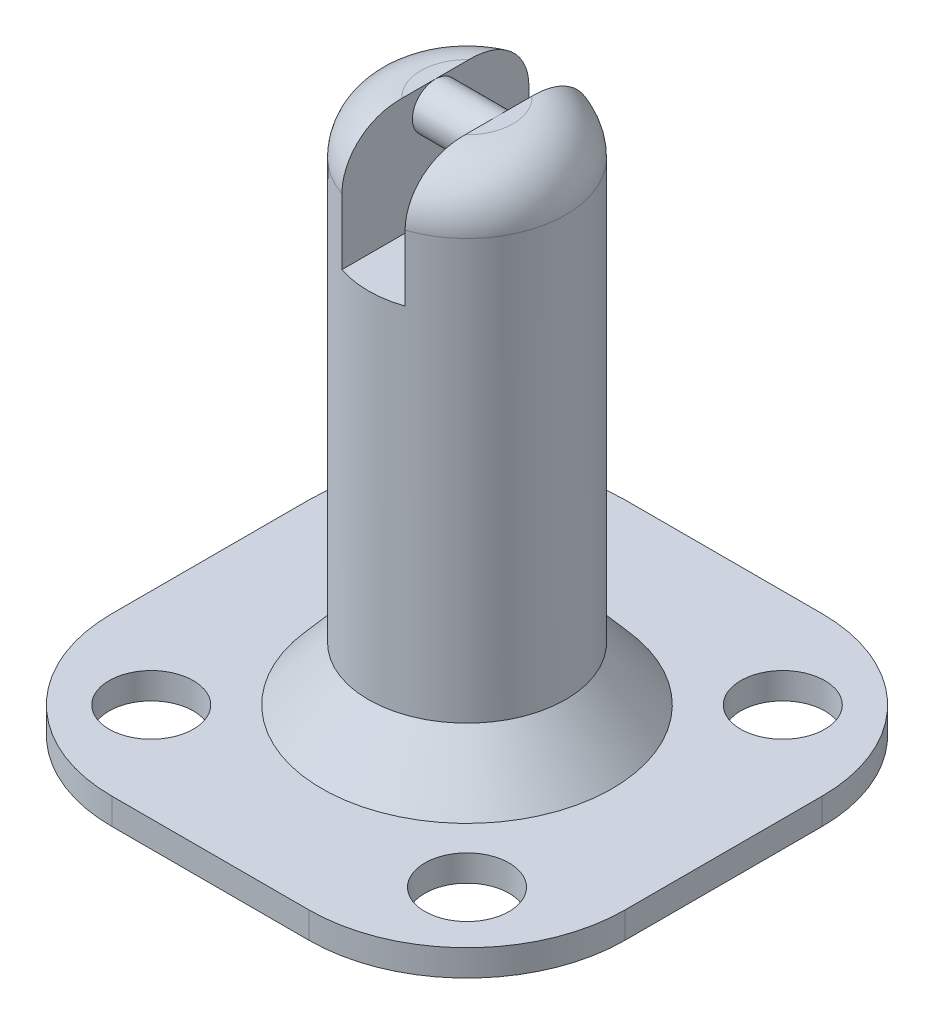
from build123d import *

# Parameters (mm, degrees)
ESQUISSE1_R                  = 3.75
BOSS_EXTRU_1_DEPTH           = 20
ENL_V_MAT_EXTRU_2_DEPTH      = 1.2
ENL_V_MAT_EXTRU_2_DEPTH_BACK = 1.2
ESQUISSE3_W                  = 7.5
ESQUISSE3_H                  = 3.5
ESQUISSE4_R                  = 0.875
BOSS_EXTRU_3_DEPTH           = 2.4
ENL_V_MAT_EXTRU_3_DEPTH      = 21.691181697
ENL_V_MAT_EXTRU_3_DEPTH_BACK = 21.691181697
ESQUISSE5_W                  = 2.4
ESQUISSE5_H                  = 1
CONG_1_R                     = 2
ESQUISSE7_W                  = 19.5
ESQUISSE7_H                  = 19.5
BOSS_EXTRU_4_DEPTH           = 1
CONG_2_R                     = 6
ENL_V_MAT_EXTRU_4_DEPTH      = 2


with BuildPart() as part:
    # Esquisse1 → Boss.-Extru.1 (new body)
    with BuildSketch(Plane(origin=(0, 0, 0), x_dir=(1, 0, 0), z_dir=(0, 1, 0))):
        with Locations(Location((0, 0, 0), (0, 0, 270))):
            Circle(ESQUISSE1_R)
    extrude(amount=BOSS_EXTRU_1_DEPTH)

    # Esquisse3 → Enl_v. mat.-Extru.2 (cut, two sides: drawn at the far end of the back side and taken through both)
    with BuildSketch(Plane(origin=(0, 0, 0), x_dir=(0, 0, -1), z_dir=(1, 0, 0)).offset(-ENL_V_MAT_EXTRU_2_DEPTH_BACK)):
        with Locations((0, 18.25)):
            Rectangle(ESQUISSE3_W, ESQUISSE3_H)
    extrude(amount=ENL_V_MAT_EXTRU_2_DEPTH + ENL_V_MAT_EXTRU_2_DEPTH_BACK, mode=Mode.SUBTRACT)

    # Esquisse4 → Boss.-Extru.3 (add)
    with BuildSketch(Plane(origin=(-1.2, 0, 0), x_dir=(0, 0, -1), z_dir=(1, 0, 0))):
        with Locations((0, 19.12)):
            Circle(ESQUISSE4_R)
    extrude(amount=BOSS_EXTRU_3_DEPTH)

    # Esquisse5 → Enl_v. mat.-Extru.3 (cut, two sides: drawn at the far end of the back side and taken through both)
    with BuildSketch(Plane.XY.offset(-ENL_V_MAT_EXTRU_3_DEPTH_BACK)):
        with Locations((0, 16)):
            Rectangle(ESQUISSE5_W, ESQUISSE5_H)
    extrude(amount=ENL_V_MAT_EXTRU_3_DEPTH + ENL_V_MAT_EXTRU_3_DEPTH_BACK, mode=Mode.SUBTRACT)

    # Cong_1
    cong_1_edges = [part.edges().sort_by_distance(p)[0] for p in [
        (3.75, 20, 0),
        (-3.75, 20, 0),
    ]]
    fillet(cong_1_edges, radius=CONG_1_R)

    # Esquisse6 → R_volution1 (revolve)
    with BuildSketch(Plane.XY, mode=Mode.PRIVATE) as r_volution1_sk:
        Polygon((-3.75, 0), (-5.516949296, 0), (-3.75, 2.048416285), align=None)
    revolve(r_volution1_sk.sketch.rotate(Axis((0, 18, 0), (0, -1, 0)), 71.337075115), axis=Axis((0, 18, 0), (0, -1, 0)))

    # Esquisse7 → Boss.-Extru.4 (add)
    with BuildSketch(Plane.XZ):
        Rectangle(ESQUISSE7_W, ESQUISSE7_H)
    extrude(amount=BOSS_EXTRU_4_DEPTH)

    # Cong_2
    cong_2_edges = [part.edges().sort_by_distance(p)[0] for p in [
        (-9.75, -0.5, 9.75),
        (-9.75, -0.5, -9.75),
        (9.75, -0.5, -9.75),
        (9.75, -0.5, 9.75),
    ]]
    fillet(cong_2_edges, radius=CONG_2_R)

    # Esquisse8 → Enl_v. mat.-Extru.4 (cut)
    with BuildSketch(Plane(origin=(0, 0, 0), x_dir=(1, 0, 0), z_dir=(0, 1, 0))):
        with BuildLine():
            Line((-6, 4.4), (-6, 6))
            Line((-6, 6), (-4.4, 6))
            ThreePointArc((-4.4, 6), (-7.13137085, 7.13137085), (-6, 4.4))
        make_face()
        with BuildLine():
            Line((-4.4, 6), (-6, 6))
            Line((-6, 6), (-6, 4.4))
            ThreePointArc((-6, 4.4), (-4.86862915, 4.86862915), (-4.4, 6))
        make_face()
        with BuildLine():
            Line((-6, 4.4), (-6, 6))
            Line((-6, 6), (-4.4, 6))
            ThreePointArc((-4.4, 6), (-7.13137085, 7.13137085), (-6, 4.4))
        make_face()
        with BuildLine():
            Line((-4.4, 6), (-6, 6))
            Line((-6, 6), (-6, 4.4))
            ThreePointArc((-6, 4.4), (-4.86862915, 4.86862915), (-4.4, 6))
        make_face()
        with BuildLine():
            ThreePointArc((7.6, 6), (6, 7.6), (4.4, 6))
            Line((4.4, 6), (6, 6))
            Line((6, 6), (6, 4.4))
            ThreePointArc((6, 4.4), (7.13137085, 4.86862915), (7.6, 6))
        make_face()
        with BuildLine():
            Line((6, 6), (4.4, 6))
            ThreePointArc((4.4, 6), (4.86862915, 4.86862915), (6, 4.4))
            Line((6, 4.4), (6, 6))
        make_face()
        with BuildLine():
            ThreePointArc((7.6, 6), (6, 7.6), (4.4, 6))
            Line((4.4, 6), (6, 6))
            Line((6, 6), (6, 4.4))
            ThreePointArc((6, 4.4), (7.13137085, 4.86862915), (7.6, 6))
        make_face()
        with BuildLine():
            Line((6, 6), (4.4, 6))
            ThreePointArc((4.4, 6), (4.86862915, 4.86862915), (6, 4.4))
            Line((6, 4.4), (6, 6))
        make_face()
        with BuildLine():
            ThreePointArc((7.6, -6), (7.13137085, -4.86862915), (6, -4.4))
            Line((6, -4.4), (6, -6))
            Line((6, -6), (4.4, -6))
            ThreePointArc((4.4, -6), (6, -7.6), (7.6, -6))
        make_face()
        with BuildLine():
            Line((6, -6), (6, -4.4))
            ThreePointArc((6, -4.4), (4.86862915, -4.86862915), (4.4, -6))
            Line((4.4, -6), (6, -6))
        make_face()
        with BuildLine():
            ThreePointArc((7.6, -6), (7.13137085, -4.86862915), (6, -4.4))
            Line((6, -4.4), (6, -6))
            Line((6, -6), (4.4, -6))
            ThreePointArc((4.4, -6), (6, -7.6), (7.6, -6))
        make_face()
        with BuildLine():
            Line((6, -6), (6, -4.4))
            ThreePointArc((6, -4.4), (4.86862915, -4.86862915), (4.4, -6))
            Line((4.4, -6), (6, -6))
        make_face()
        with BuildLine():
            ThreePointArc((-4.4, -6), (-4.86862915, -4.86862915), (-6, -4.4))
            Line((-6, -4.4), (-6, -6))
            Line((-6, -6), (-4.4, -6))
        make_face()
        with BuildLine():
            Line((-6, -6), (-6, -4.4))
            ThreePointArc((-6, -4.4), (-7.13137085, -7.13137085), (-4.4, -6))
            Line((-4.4, -6), (-6, -6))
        make_face()
        with BuildLine():
            ThreePointArc((-4.4, -6), (-4.86862915, -4.86862915), (-6, -4.4))
            Line((-6, -4.4), (-6, -6))
            Line((-6, -6), (-4.4, -6))
        make_face()
        with BuildLine():
            Line((-6, -6), (-6, -4.4))
            ThreePointArc((-6, -4.4), (-7.13137085, -7.13137085), (-4.4, -6))
            Line((-4.4, -6), (-6, -6))
        make_face()
    extrude(amount=-ENL_V_MAT_EXTRU_4_DEPTH, mode=Mode.SUBTRACT)


solid = part.part
